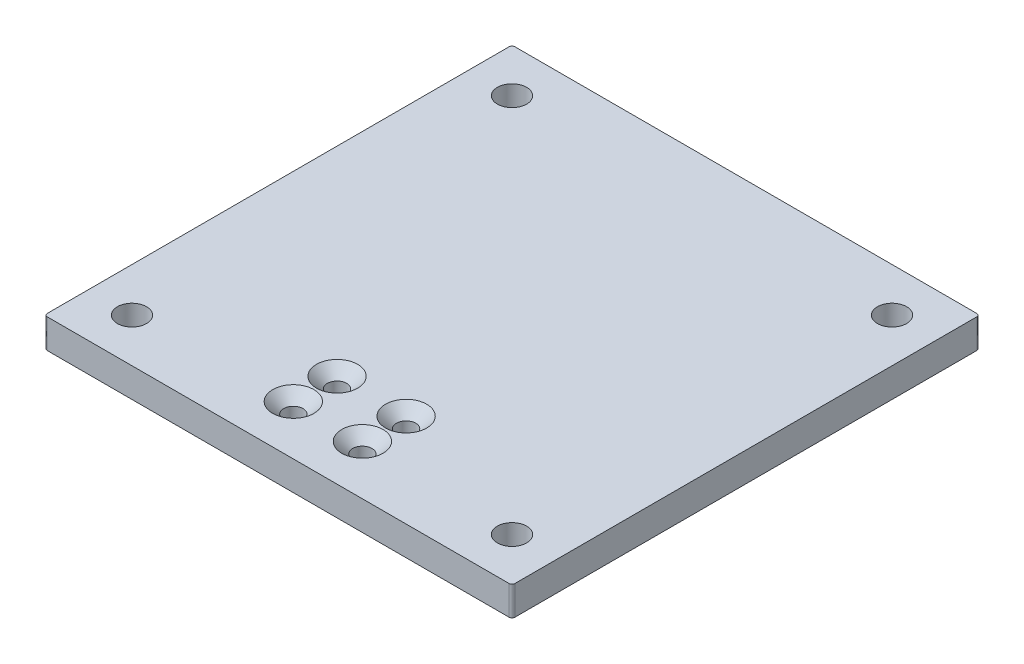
from build123d import *

# Parameters (mm, degrees)
SKETCH1_W                     = 203.2
SKETCH1_H                     = 203.2
SKETCH1_R                     = 6.35
EXTRUDE1_DEPTH                = 12.7
CSK_FOR_M8_SFHCS2_D           = 8.4
CSK_FOR_M8_SFHCS2_CSINK_D     = 17.92
CSK_FOR_M8_SFHCS2_CSINK_ANGLE = 90
LPATTERN1_COUNT               = 2
LPATTERN1_PITCH               = 19
MIRROR1_COPY_1_D              = 8.4
MIRROR1_COPY_1_CSINK_D        = 17.92
MIRROR1_COPY_1_CSINK_ANGLE    = 90
FILLET1_R                     = 1.27


with BuildPart() as part:
    # Sketch1 → Extrude1 (new body)
    with BuildSketch(Plane(origin=(0, 0, 0), x_dir=(1, 0, 0), z_dir=(0, 1, 0))):
        Rectangle(SKETCH1_W, SKETCH1_H)
        with Locations(Location((-82.55, 82.55, 0), (0, 0, 270))):
            Circle(SKETCH1_R, mode=Mode.SUBTRACT)
        with Locations(Location((-82.55, -82.55, 0), (0, 0, 90))):
            Circle(SKETCH1_R, mode=Mode.SUBTRACT)
        with Locations(Location((82.55, -82.55, 0), (0, 0, 270))):
            Circle(SKETCH1_R, mode=Mode.SUBTRACT)
        with Locations(Location((82.55, 82.55, 0), (0, 0, 90))):
            Circle(SKETCH1_R, mode=Mode.SUBTRACT)
    extrude(amount=EXTRUDE1_DEPTH)

    # CSK for M8 SFHCS2 (through all)
    with Locations(Plane(origin=(-15, 12.7, 61), x_dir=(0, 0, 1), z_dir=(0, 1, 0))):
        with Locations((0, 0)):
            csk_for_m8_sfhcs2 = CounterSinkHole(CSK_FOR_M8_SFHCS2_D / 2, CSK_FOR_M8_SFHCS2_CSINK_D / 2, counter_sink_angle=CSK_FOR_M8_SFHCS2_CSINK_ANGLE)

    # LPattern1: CSK for M8 SFHCS2 ×2
    with Locations(*[(0, 0, i * LPATTERN1_PITCH) for i in range(1, LPATTERN1_COUNT)]):
        add(csk_for_m8_sfhcs2, mode=Mode.SUBTRACT)

    # Mirror1: CSK for M8 SFHCS2 across plane
    add(csk_for_m8_sfhcs2.mirror(Plane(origin=(0, 0, 0), x_dir=(0, 0, 1), z_dir=(1, 0, 0))), mode=Mode.SUBTRACT)

    # Mirror1 copy 1 (through all)
    with Locations(Plane(origin=(15, 12.7, 80), x_dir=(0, 0, 1), z_dir=(0, 1, 0))):
        with Locations((0, 0)):
            CounterSinkHole(MIRROR1_COPY_1_D / 2, MIRROR1_COPY_1_CSINK_D / 2, counter_sink_angle=MIRROR1_COPY_1_CSINK_ANGLE)

    # Fillet1
    fillet1_edges = [part.edges().sort_by_distance(p)[0] for p in [
        (101.6, 6.35, 101.6),
        (-101.6, 6.35, 101.6),
        (-101.6, 6.35, -101.6),
        (101.6, 6.35, -101.6),
    ]]
    fillet(fillet1_edges, radius=FILLET1_R)


solid = part.part
